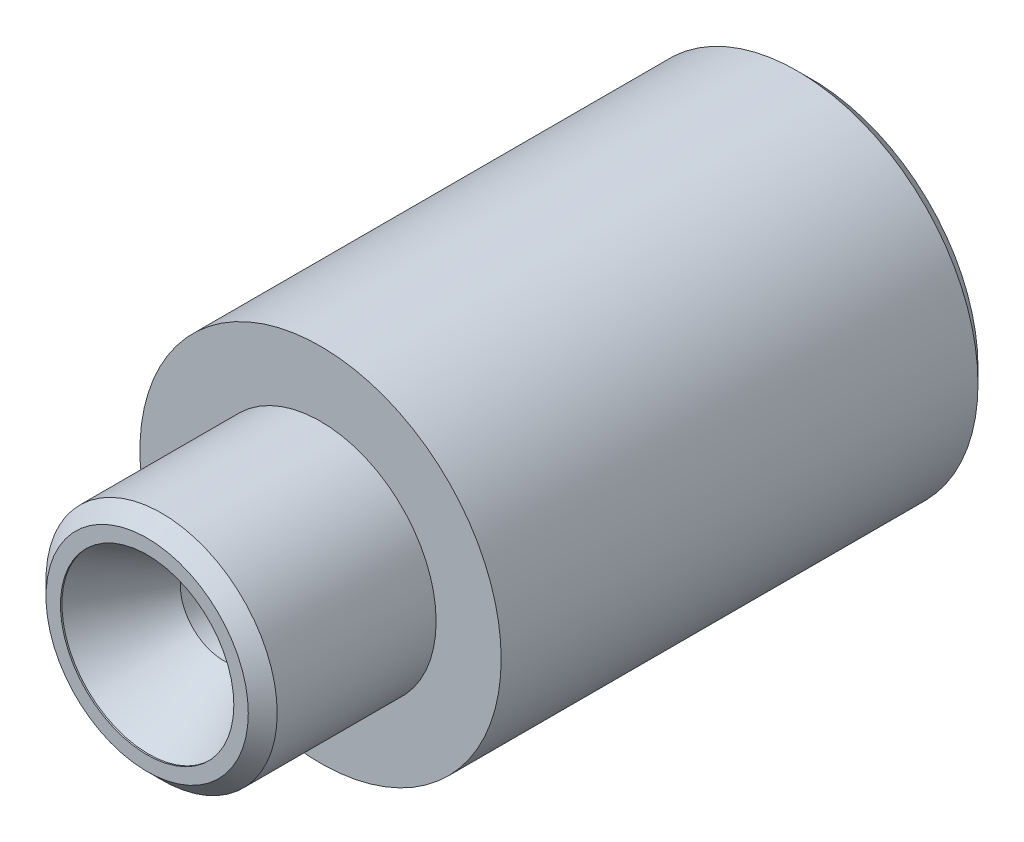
from build123d import *

# Parameters (mm, degrees)
ESQUISSE1_R     = 6.25
CYLINDRE_DEPTH  = 17
ESQUISSE2_R     = 4
PAULEMENT_DEPTH = 6
CHANFREIN1_SIZE = 0.5
PER_AGE_D       = 3.5
PER_AGE_DEPTH   = 12.5
PER_AGE_TIP     = 1.051506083


with BuildPart() as part:
    # Esquisse1 → cylindre (new body)
    with BuildSketch(Plane.XY):
        Circle(ESQUISSE1_R)
    extrude(amount=CYLINDRE_DEPTH)

    # Esquisse2 → paulement (add)
    with BuildSketch(Plane.XY.offset(17)):
        Circle(ESQUISSE2_R)
    extrude(amount=PAULEMENT_DEPTH)

    # Chanfrein1
    chanfrein1_edges = [part.edges().sort_by_distance(p)[0] for p in [
        (-6.25, 0, 0),
        (-4, 0, 23),
    ]]
    chamfer(chanfrein1_edges, length=CHANFREIN1_SIZE)

    # Per_age
    with Locations(Plane(origin=(0, 0, 0), x_dir=(-1, 0, 0), z_dir=(0, 0, -1))):
        with Locations((0, 0)):
            Hole(PER_AGE_D / 2, depth=PER_AGE_DEPTH)
            with Locations((0, 0, -(PER_AGE_DEPTH + PER_AGE_TIP / 2))):  # 118° drill point
                Cone(0, PER_AGE_D / 2, PER_AGE_TIP, mode=Mode.SUBTRACT)

    # Esquisse13 → contre-pointe (revolve, cut)
    with BuildSketch(Plane(origin=(0, 0, 23), x_dir=(0, -1, 0), z_dir=(1, 0, 0))):
        Polygon((0, 0), (0, 5.366025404), (1.5, 4.5), (1.5, 2.648076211), (3, 0.05), (3, 0), align=None)
    revolve(axis=Axis((0, 0, 29.130023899), (0, 0, -1)), mode=Mode.SUBTRACT)


solid = part.part
